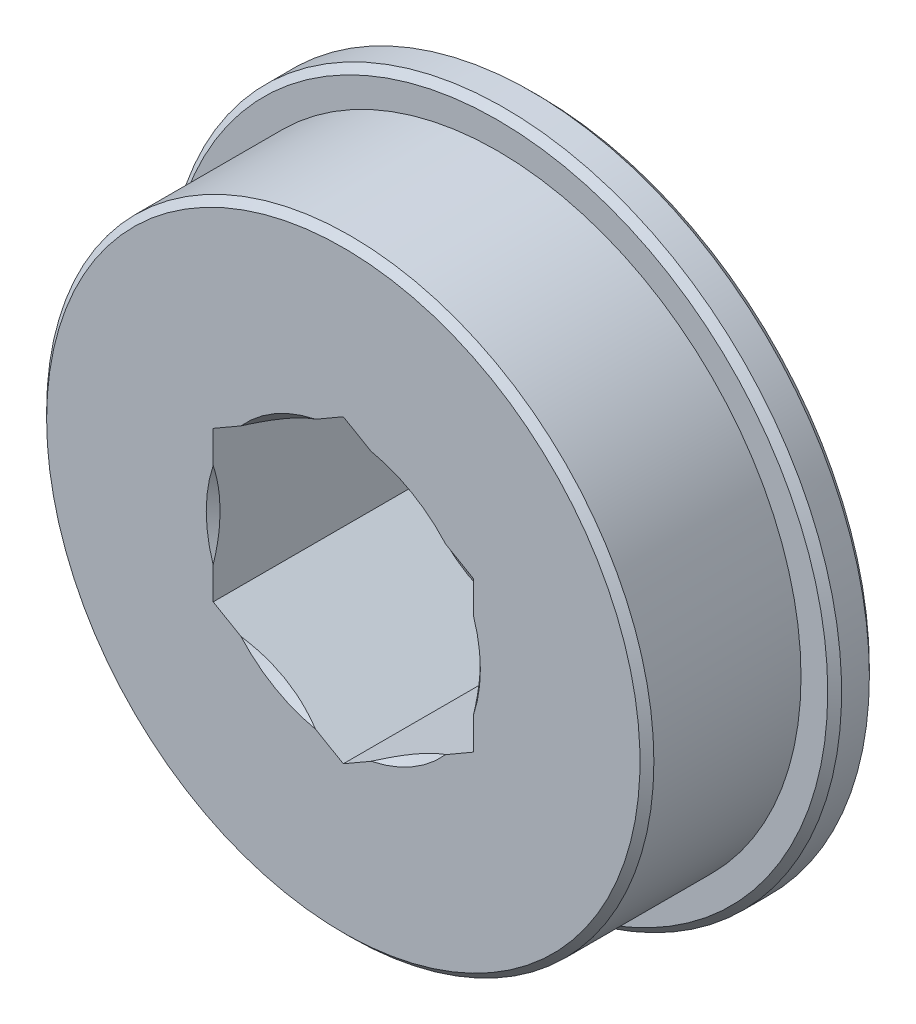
ISO-10303-21;
HEADER;
FILE_DESCRIPTION(('STEP AP214'),'2;1');
FILE_NAME('part.step','',(''),(''),'','','');
FILE_SCHEMA(('AUTOMOTIVE_DESIGN { 1 0 10303 214 1 1 1 1 }'));
ENDSEC;
DATA;
#1=APPLICATION_CONTEXT('core data for automotive mechanical design processes');
#2=APPLICATION_PROTOCOL_DEFINITION('international standard','automotive_design',2000,#1);
#3=PRODUCT_CONTEXT('',#1,'mechanical');
#4=PRODUCT('Part','Part','',(#3));
#5=PRODUCT_RELATED_PRODUCT_CATEGORY('part','',(#4));
#6=PRODUCT_DEFINITION_FORMATION('','',#4);
#7=PRODUCT_DEFINITION_CONTEXT('part definition',#1,'design');
#8=PRODUCT_DEFINITION('design','',#6,#7);
#9=PRODUCT_DEFINITION_SHAPE('','',#8);
#10=(LENGTH_UNIT() NAMED_UNIT(*) SI_UNIT(.MILLI.,.METRE.));
#11=(NAMED_UNIT(*) PLANE_ANGLE_UNIT() SI_UNIT($,.RADIAN.));
#12=(NAMED_UNIT(*) SI_UNIT($,.STERADIAN.) SOLID_ANGLE_UNIT());
#13=UNCERTAINTY_MEASURE_WITH_UNIT(LENGTH_MEASURE(1.E-05),#10,'distance_accuracy_value','');
#14=(GEOMETRIC_REPRESENTATION_CONTEXT(3) GLOBAL_UNCERTAINTY_ASSIGNED_CONTEXT((#13)) GLOBAL_UNIT_ASSIGNED_CONTEXT((#10,
#11,#12)) REPRESENTATION_CONTEXT('',''));
#15=CARTESIAN_POINT('',(0.,0.,0.));
#16=DIRECTION('',(0.,0.,1.));
#17=DIRECTION('',(1.,0.,0.));
#18=AXIS2_PLACEMENT_3D('',#15,#16,#17);
#19=CARTESIAN_POINT('',(-8.86153846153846,6.04195804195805,7.1628));
#20=DIRECTION('',(0.,0.,-1.));
#21=DIRECTION('',(-1.,0.,0.));
#22=AXIS2_PLACEMENT_3D('',#19,#20,#21);
#23=CYLINDRICAL_SURFACE('',#22,11.1125);
#24=CARTESIAN_POINT('',(-8.86153846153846,6.04195804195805,1.524));
#25=DIRECTION('',(0.,0.,-1.));
#26=DIRECTION('',(-1.,0.,0.));
#27=AXIS2_PLACEMENT_3D('',#24,#25,#26);
#28=CIRCLE('',#27,11.1125);
#29=CARTESIAN_POINT('',(-19.9740384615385,6.04195804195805,1.524));
#30=VERTEX_POINT('',#29);
#31=EDGE_CURVE('E20',#30,#30,#28,.F.);
#32=ORIENTED_EDGE('',*,*,#31,.T.);
#33=EDGE_LOOP('',(#32));
#34=FACE_BOUND('',#33,.T.);
#35=CARTESIAN_POINT('',(-8.86153846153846,6.04195804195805,6.90879999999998));
#36=DIRECTION('',(0.,0.,-1.));
#37=DIRECTION('',(-1.,0.,0.));
#38=AXIS2_PLACEMENT_3D('',#35,#36,#37);
#39=CIRCLE('',#38,11.1125);
#40=CARTESIAN_POINT('',(-19.9740384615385,6.04195804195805,6.90879999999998));
#41=VERTEX_POINT('',#40);
#42=EDGE_CURVE('E181',#41,#41,#39,.F.);
#43=ORIENTED_EDGE('',*,*,#42,.F.);
#44=EDGE_LOOP('',(#43));
#45=FACE_BOUND('',#44,.T.);
#46=ADVANCED_FACE('F17',(#34,#45),#23,.T.);
#47=CARTESIAN_POINT('',(-8.86153846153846,6.04195804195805,6.90879999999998));
#48=DIRECTION('',(0.,0.,-1.));
#49=DIRECTION('',(-1.,0.,0.));
#50=AXIS2_PLACEMENT_3D('',#47,#48,#49);
#51=CONICAL_SURFACE('',#50,11.1125,0.785398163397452);
#52=ORIENTED_EDGE('',*,*,#42,.T.);
#53=EDGE_LOOP('',(#52));
#54=FACE_BOUND('',#53,.T.);
#55=CARTESIAN_POINT('',(-8.86153846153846,6.04195804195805,7.16279999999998));
#56=DIRECTION('',(0.,0.,-1.));
#57=DIRECTION('',(-1.,0.,0.));
#58=AXIS2_PLACEMENT_3D('',#55,#56,#57);
#59=CIRCLE('',#58,10.8585);
#60=CARTESIAN_POINT('',(-19.7200384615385,6.04195804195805,7.16279999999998));
#61=VERTEX_POINT('',#60);
#62=EDGE_CURVE('E158',#61,#61,#59,.T.);
#63=ORIENTED_EDGE('',*,*,#62,.T.);
#64=EDGE_LOOP('',(#63));
#65=FACE_BOUND('',#64,.T.);
#66=ADVANCED_FACE('F486',(#54,#65),#51,.T.);
#67=CARTESIAN_POINT('',(-8.86153846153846,6.04195804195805,1.524));
#68=DIRECTION('',(0.,0.,-1.));
#69=DIRECTION('',(-1.,0.,0.));
#70=AXIS2_PLACEMENT_3D('',#67,#68,#69);
#71=PLANE('',#70);
#72=ORIENTED_EDGE('',*,*,#31,.F.);
#73=EDGE_LOOP('',(#72));
#74=FACE_BOUND('',#73,.T.);
#75=CARTESIAN_POINT('',(-8.86153846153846,6.04195804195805,1.52399999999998));
#76=DIRECTION('',(0.,0.,-1.));
#77=DIRECTION('',(-1.,0.,0.));
#78=AXIS2_PLACEMENT_3D('',#75,#76,#77);
#79=CIRCLE('',#78,12.0904);
#80=CARTESIAN_POINT('',(-20.9519384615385,6.04195804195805,1.52399999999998));
#81=VERTEX_POINT('',#80);
#82=EDGE_CURVE('E470',#81,#81,#79,.T.);
#83=ORIENTED_EDGE('',*,*,#82,.F.);
#84=EDGE_LOOP('',(#83));
#85=FACE_BOUND('',#84,.T.);
#86=ADVANCED_FACE('F483',(#74,#85),#71,.F.);
#87=CARTESIAN_POINT('',(-8.86153846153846,6.04195804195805,7.1628));
#88=DIRECTION('',(0.,0.,-1.));
#89=DIRECTION('',(-1.,0.,0.));
#90=AXIS2_PLACEMENT_3D('',#87,#88,#89);
#91=PLANE('',#90);
#92=DIRECTION('',(0.,1.,0.));
#93=VECTOR('',#92,1.);
#94=CARTESIAN_POINT('',(-13.6240384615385,6.04195804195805,7.1628));
#95=LINE('',#94,#93);
#96=CARTESIAN_POINT('',(-13.6240384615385,4.46592948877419,7.1627999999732));
#97=VERTEX_POINT('',#96);
#98=CARTESIAN_POINT('',(-13.6240384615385,3.29232738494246,7.1628));
#99=VERTEX_POINT('',#98);
#100=EDGE_CURVE('E123',#97,#99,#95,.F.);
#101=ORIENTED_EDGE('',*,*,#100,.F.);
#102=CARTESIAN_POINT('',(-8.86153846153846,6.04195804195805,7.1627999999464));
#103=DIRECTION('',(0.,0.,1.));
#104=DIRECTION('',(0.,-1.,0.));
#105=AXIS2_PLACEMENT_3D('',#102,#103,#104);
#106=CIRCLE('',#105,5.01650000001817);
#107=CARTESIAN_POINT('',(-13.6240384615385,7.61798659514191,7.1627999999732));
#108=VERTEX_POINT('',#107);
#109=EDGE_CURVE('E423',#97,#108,#106,.F.);
#110=ORIENTED_EDGE('',*,*,#109,.T.);
#111=DIRECTION('',(0.,1.,0.));
#112=VECTOR('',#111,1.);
#113=CARTESIAN_POINT('',(-13.6240384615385,6.04195804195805,7.1628));
#114=LINE('',#113,#112);
#115=CARTESIAN_POINT('',(-13.6240384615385,8.79158869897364,7.1628));
#116=VERTEX_POINT('',#115);
#117=EDGE_CURVE('E115',#116,#108,#114,.F.);
#118=ORIENTED_EDGE('',*,*,#117,.F.);
#119=DIRECTION('',(-0.866025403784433,-0.500000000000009,0.));
#120=VECTOR('',#119,1.);
#121=CARTESIAN_POINT('',(-12.6076692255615,9.37838975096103,7.1628));
#122=LINE('',#121,#120);
#123=CARTESIAN_POINT('',(-12.6076692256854,9.37838975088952,7.1627999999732));
#124=VERTEX_POINT('',#123);
#125=EDGE_CURVE('E430',#124,#116,#122,.T.);
#126=ORIENTED_EDGE('',*,*,#125,.F.);
#127=CARTESIAN_POINT('',(-8.86153846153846,6.04195804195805,7.1627999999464));
#128=DIRECTION('',(0.,0.,1.));
#129=DIRECTION('',(0.,-1.,0.));
#130=AXIS2_PLACEMENT_3D('',#127,#128,#129);
#131=CIRCLE('',#130,5.01650000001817);
#132=CARTESIAN_POINT('',(-9.87790769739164,10.9544183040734,7.1627999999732));
#133=VERTEX_POINT('',#132);
#134=EDGE_CURVE('E463',#124,#133,#131,.F.);
#135=ORIENTED_EDGE('',*,*,#134,.T.);
#136=DIRECTION('',(-0.866025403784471,-0.499999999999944,0.));
#137=VECTOR('',#136,1.);
#138=CARTESIAN_POINT('',(-8.86153846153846,11.5412193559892,7.1628));
#139=LINE('',#138,#137);
#140=CARTESIAN_POINT('',(-8.86153846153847,11.5412193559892,7.1628));
#141=VERTEX_POINT('',#140);
#142=EDGE_CURVE('E434',#141,#133,#139,.T.);
#143=ORIENTED_EDGE('',*,*,#142,.F.);
#144=DIRECTION('',(-0.866025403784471,0.499999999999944,0.));
#145=VECTOR('',#144,1.);
#146=CARTESIAN_POINT('',(-7.84516922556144,10.9544183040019,7.1628));
#147=LINE('',#146,#145);
#148=CARTESIAN_POINT('',(-7.84516922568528,10.9544183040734,7.1627999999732));
#149=VERTEX_POINT('',#148);
#150=EDGE_CURVE('E438',#149,#141,#147,.T.);
#151=ORIENTED_EDGE('',*,*,#150,.F.);
#152=CARTESIAN_POINT('',(-8.86153846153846,6.04195804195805,7.1627999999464));
#153=DIRECTION('',(0.,0.,1.));
#154=DIRECTION('',(0.,-1.,0.));
#155=AXIS2_PLACEMENT_3D('',#152,#153,#154);
#156=CIRCLE('',#155,5.01650000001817);
#157=CARTESIAN_POINT('',(-5.11540769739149,9.37838975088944,7.1627999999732));
#158=VERTEX_POINT('',#157);
#159=EDGE_CURVE('E460',#149,#158,#156,.F.);
#160=ORIENTED_EDGE('',*,*,#159,.T.);
#161=DIRECTION('',(-0.866025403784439,0.499999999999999,0.));
#162=VECTOR('',#161,1.);
#163=CARTESIAN_POINT('',(-4.09903846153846,8.79158869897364,7.1628));
#164=LINE('',#163,#162);
#165=CARTESIAN_POINT('',(-4.09903846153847,8.79158869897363,7.1628));
#166=VERTEX_POINT('',#165);
#167=EDGE_CURVE('E442',#166,#158,#164,.T.);
#168=ORIENTED_EDGE('',*,*,#167,.F.);
#169=DIRECTION('',(0.,1.,0.));
#170=VECTOR('',#169,1.);
#171=CARTESIAN_POINT('',(-4.09903846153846,6.04195804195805,7.1628));
#172=LINE('',#171,#170);
#173=CARTESIAN_POINT('',(-4.09903846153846,7.61798659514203,7.1627999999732));
#174=VERTEX_POINT('',#173);
#175=EDGE_CURVE('E446',#174,#166,#172,.T.);
#176=ORIENTED_EDGE('',*,*,#175,.F.);
#177=CARTESIAN_POINT('',(-8.86153846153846,6.04195804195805,7.1627999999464));
#178=DIRECTION('',(0.,0.,1.));
#179=DIRECTION('',(0.,-1.,0.));
#180=AXIS2_PLACEMENT_3D('',#177,#178,#179);
#181=CIRCLE('',#180,5.01650000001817);
#182=CARTESIAN_POINT('',(-4.09903846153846,4.46592948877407,7.1627999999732));
#183=VERTEX_POINT('',#182);
#184=EDGE_CURVE('E458',#174,#183,#181,.F.);
#185=ORIENTED_EDGE('',*,*,#184,.T.);
#186=DIRECTION('',(0.,1.,0.));
#187=VECTOR('',#186,1.);
#188=CARTESIAN_POINT('',(-4.09903846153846,6.04195804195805,7.1628));
#189=LINE('',#188,#187);
#190=CARTESIAN_POINT('',(-4.09903846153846,3.29232738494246,7.1628));
#191=VERTEX_POINT('',#190);
#192=EDGE_CURVE('E172',#191,#183,#189,.T.);
#193=ORIENTED_EDGE('',*,*,#192,.F.);
#194=DIRECTION('',(0.866025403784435,0.500000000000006,0.));
#195=VECTOR('',#194,1.);
#196=CARTESIAN_POINT('',(-5.11540769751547,2.70552633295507,7.1628));
#197=LINE('',#196,#195);
#198=CARTESIAN_POINT('',(-5.11540769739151,2.70552633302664,7.1627999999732));
#199=VERTEX_POINT('',#198);
#200=EDGE_CURVE('E140',#199,#191,#197,.T.);
#201=ORIENTED_EDGE('',*,*,#200,.F.);
#202=CARTESIAN_POINT('',(-8.86153846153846,6.04195804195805,7.1627999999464));
#203=DIRECTION('',(0.,0.,1.));
#204=DIRECTION('',(0.,-1.,0.));
#205=AXIS2_PLACEMENT_3D('',#202,#203,#204);
#206=CIRCLE('',#205,5.01650000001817);
#207=CARTESIAN_POINT('',(-7.84516922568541,1.12949777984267,7.1627999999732));
#208=VERTEX_POINT('',#207);
#209=EDGE_CURVE('E169',#199,#208,#206,.F.);
#210=ORIENTED_EDGE('',*,*,#209,.T.);
#211=DIRECTION('',(0.866025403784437,0.500000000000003,0.));
#212=VECTOR('',#211,1.);
#213=CARTESIAN_POINT('',(-8.86153846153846,0.542696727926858,7.1628));
#214=LINE('',#213,#212);
#215=CARTESIAN_POINT('',(-8.86153846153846,0.542696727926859,7.1628));
#216=VERTEX_POINT('',#215);
#217=EDGE_CURVE('E157',#216,#208,#214,.T.);
#218=ORIENTED_EDGE('',*,*,#217,.F.);
#219=DIRECTION('',(0.866025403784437,-0.500000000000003,0.));
#220=VECTOR('',#219,1.);
#221=CARTESIAN_POINT('',(-9.87790769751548,1.12949777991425,7.1628));
#222=LINE('',#221,#220);
#223=CARTESIAN_POINT('',(-9.87790769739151,1.12949777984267,7.1627999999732));
#224=VERTEX_POINT('',#223);
#225=EDGE_CURVE('E146',#224,#216,#222,.T.);
#226=ORIENTED_EDGE('',*,*,#225,.F.);
#227=CARTESIAN_POINT('',(-8.86153846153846,6.04195804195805,7.1627999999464));
#228=DIRECTION('',(0.,0.,1.));
#229=DIRECTION('',(0.,-1.,0.));
#230=AXIS2_PLACEMENT_3D('',#227,#228,#229);
#231=CIRCLE('',#230,5.01650000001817);
#232=CARTESIAN_POINT('',(-12.6076692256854,2.70552633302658,7.1627999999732));
#233=VERTEX_POINT('',#232);
#234=EDGE_CURVE('E465',#224,#233,#231,.F.);
#235=ORIENTED_EDGE('',*,*,#234,.T.);
#236=DIRECTION('',(0.866025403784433,-0.50000000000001,0.));
#237=VECTOR('',#236,1.);
#238=CARTESIAN_POINT('',(-13.6240384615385,3.29232738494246,7.1628));
#239=LINE('',#238,#237);
#240=EDGE_CURVE('E421',#99,#233,#239,.T.);
#241=ORIENTED_EDGE('',*,*,#240,.F.);
#242=EDGE_LOOP('',(#101,#110,#118,#126,#135,#143,#151,#160,#168,#176,#185,#193,#201,#210,#218,
#226,#235,#241));
#243=FACE_BOUND('',#242,.T.);
#244=ORIENTED_EDGE('',*,*,#62,.F.);
#245=EDGE_LOOP('',(#244));
#246=FACE_BOUND('',#245,.T.);
#247=ADVANCED_FACE('F166',(#243,#246),#91,.F.);
#248=CARTESIAN_POINT('',(-8.86153846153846,6.04195804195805,7.1627999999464));
#249=DIRECTION('',(0.,0.,1.));
#250=DIRECTION('',(0.,-1.,0.));
#251=AXIS2_PLACEMENT_3D('',#248,#249,#250);
#252=CONICAL_SURFACE('',#251,5.01650000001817,0.785398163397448);
#253=ORIENTED_EDGE('',*,*,#109,.F.);
#254=CARTESIAN_POINT('',(-13.6240384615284,7.61798659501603,7.16279999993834));
#255=CARTESIAN_POINT('',(-13.6240384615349,7.49847319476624,7.12522654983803));
#256=CARTESIAN_POINT('',(-13.6240384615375,7.3777880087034,7.09118390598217));
#257=CARTESIAN_POINT('',(-13.6240384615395,7.13432202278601,7.03105245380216));
#258=CARTESIAN_POINT('',(-13.6240384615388,7.01153908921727,7.00497232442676));
#259=CARTESIAN_POINT('',(-13.6240384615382,6.76726049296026,6.9622463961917));
#260=CARTESIAN_POINT('',(-13.6240384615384,6.64580129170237,6.94539531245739));
#261=CARTESIAN_POINT('',(-13.6240384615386,6.40201664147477,6.92085246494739));
#262=CARTESIAN_POINT('',(-13.6240384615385,6.27969165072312,6.91315617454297));
#263=CARTESIAN_POINT('',(-13.6240384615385,6.01608974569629,6.90678178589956));
#264=CARTESIAN_POINT('',(-13.6240384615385,5.87477215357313,6.90966083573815));
#265=CARTESIAN_POINT('',(-13.6240384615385,5.59284499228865,6.92785662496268));
#266=CARTESIAN_POINT('',(-13.6240384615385,5.45223605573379,6.94318298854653));
#267=CARTESIAN_POINT('',(-13.6240384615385,5.16899142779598,6.98606942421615));
#268=CARTESIAN_POINT('',(-13.6240384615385,5.0264057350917,7.01395312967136));
#269=CARTESIAN_POINT('',(-13.6240384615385,4.74399108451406,7.08058528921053));
#270=CARTESIAN_POINT('',(-13.6240384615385,4.60415854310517,7.11931846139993));
#271=CARTESIAN_POINT('',(-13.6240384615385,4.46592948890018,7.16279999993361));
#272=B_SPLINE_CURVE_WITH_KNOTS('',3,(#254,#255,#256,#257,#258,#259,#260,#261,#262,#263,#264,
#265,#266,#267,#268,#269,#270,#271),.UNSPECIFIED.,.F.,.F.,(4,2,2,2,2,2,2,2,4),(0.,
0.375875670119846,0.752159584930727,1.11969331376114,1.48704523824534,1.91051162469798,
2.33430574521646,2.76970945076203,3.20450293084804),.UNSPECIFIED.);
#273=EDGE_CURVE('E406',#108,#97,#272,.T.);
#274=ORIENTED_EDGE('',*,*,#273,.F.);
#275=EDGE_LOOP('',(#253,#274));
#276=FACE_BOUND('',#275,.T.);
#277=ADVANCED_FACE('F501',(#276),#252,.F.);
#278=CARTESIAN_POINT('',(-8.86153846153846,6.04195804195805,-1.13686837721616E-10));
#279=DIRECTION('',(0.,0.,-1.));
#280=DIRECTION('',(-1.,0.,0.));
#281=AXIS2_PLACEMENT_3D('',#278,#279,#280);
#282=CONICAL_SURFACE('',#281,5.01650000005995,0.785398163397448);
#283=CARTESIAN_POINT('',(-8.86153846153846,6.04195804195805,-5.6843418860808E-11));
#284=DIRECTION('',(0.,0.,-1.));
#285=DIRECTION('',(-1.,0.,0.));
#286=AXIS2_PLACEMENT_3D('',#283,#284,#285);
#287=CIRCLE('',#286,5.0165000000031);
#288=CARTESIAN_POINT('',(-13.6240384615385,7.61798659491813,-2.84060969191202E-11));
#289=VERTEX_POINT('',#288);
#290=CARTESIAN_POINT('',(-13.6240384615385,4.46592948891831,-5.34331540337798E-11));
#291=VERTEX_POINT('',#290);
#292=EDGE_CURVE('E473',#289,#291,#287,.F.);
#293=ORIENTED_EDGE('',*,*,#292,.F.);
#294=CARTESIAN_POINT('',(-13.6240384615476,4.46592948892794,-4.61527595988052E-11));
#295=CARTESIAN_POINT('',(-13.6240384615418,4.58544288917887,0.0375734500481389));
#296=CARTESIAN_POINT('',(-13.6240384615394,4.70612807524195,0.0716160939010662));
#297=CARTESIAN_POINT('',(-13.6240384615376,4.9495940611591,0.131747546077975));
#298=CARTESIAN_POINT('',(-13.6240384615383,5.07237699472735,0.157827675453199));
#299=CARTESIAN_POINT('',(-13.6240384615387,5.31665559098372,0.200553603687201));
#300=CARTESIAN_POINT('',(-13.6240384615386,5.43811479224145,0.217404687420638));
#301=CARTESIAN_POINT('',(-13.6240384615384,5.6818994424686,0.241947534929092));
#302=CARTESIAN_POINT('',(-13.6240384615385,5.80422443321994,0.249643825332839));
#303=CARTESIAN_POINT('',(-13.6240384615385,6.06782633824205,0.256018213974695));
#304=CARTESIAN_POINT('',(-13.6240384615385,6.20914393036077,0.253139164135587));
#305=CARTESIAN_POINT('',(-13.6240384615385,6.49107109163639,0.234943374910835));
#306=CARTESIAN_POINT('',(-13.6240384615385,6.63168002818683,0.219617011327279));
#307=CARTESIAN_POINT('',(-13.6240384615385,6.9149246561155,0.176730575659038));
#308=CARTESIAN_POINT('',(-13.6240384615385,7.05751034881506,0.148846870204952));
#309=CARTESIAN_POINT('',(-13.6240384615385,7.33992499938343,0.0822147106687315));
#310=CARTESIAN_POINT('',(-13.6240384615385,7.47975754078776,0.0434815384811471));
#311=CARTESIAN_POINT('',(-13.6240384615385,7.61798659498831,-5.04518885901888E-11));
#312=B_SPLINE_CURVE_WITH_KNOTS('',3,(#294,#295,#296,#297,#298,#299,#300,#301,#302,#303,#304,
#305,#306,#307,#308,#309,#310,#311),.UNSPECIFIED.,.F.,.F.,(4,2,2,2,2,2,2,2,4),(0.,
0.375875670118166,0.752159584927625,1.11969331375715,1.48704523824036,1.91051162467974,
2.33430574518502,2.76970945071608,3.2045029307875),.UNSPECIFIED.);
#313=EDGE_CURVE('E400',#291,#289,#312,.T.);
#314=ORIENTED_EDGE('',*,*,#313,.F.);
#315=EDGE_LOOP('',(#293,#314));
#316=FACE_BOUND('',#315,.T.);
#317=ADVANCED_FACE('F493',(#316),#282,.F.);
#318=CARTESIAN_POINT('',(-8.86153846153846,6.04195804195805,1.26999999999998));
#319=DIRECTION('',(0.,0.,-1.));
#320=DIRECTION('',(-1.,0.,0.));
#321=AXIS2_PLACEMENT_3D('',#318,#319,#320);
#322=CONICAL_SURFACE('',#321,12.3444,0.785398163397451);
#323=CARTESIAN_POINT('',(-8.86153846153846,6.04195804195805,1.27));
#324=DIRECTION('',(0.,0.,-1.));
#325=DIRECTION('',(-1.,0.,0.));
#326=AXIS2_PLACEMENT_3D('',#323,#324,#325);
#327=CIRCLE('',#326,12.3444);
#328=CARTESIAN_POINT('',(-21.2059384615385,6.04195804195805,1.27));
#329=VERTEX_POINT('',#328);
#330=EDGE_CURVE('E389',#329,#329,#327,.T.);
#331=ORIENTED_EDGE('',*,*,#330,.F.);
#332=EDGE_LOOP('',(#331));
#333=FACE_BOUND('',#332,.T.);
#334=ORIENTED_EDGE('',*,*,#82,.T.);
#335=EDGE_LOOP('',(#334));
#336=FACE_BOUND('',#335,.T.);
#337=ADVANCED_FACE('F490',(#333,#336),#322,.T.);
#338=CARTESIAN_POINT('',(-8.86153846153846,6.04195804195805,7.1627999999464));
#339=DIRECTION('',(0.,0.,1.));
#340=DIRECTION('',(0.,-1.,0.));
#341=AXIS2_PLACEMENT_3D('',#338,#339,#340);
#342=CONICAL_SURFACE('',#341,5.01650000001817,0.785398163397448);
#343=ORIENTED_EDGE('',*,*,#234,.F.);
#344=CARTESIAN_POINT('',(-12.6076692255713,2.7055263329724,7.16279999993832));
#345=CARTESIAN_POINT('',(-12.5041675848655,2.64576963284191,7.125226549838));
#346=CARTESIAN_POINT('',(-12.399651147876,2.58542703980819,7.09118390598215));
#347=CARTESIAN_POINT('',(-12.1888034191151,2.46369404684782,7.03105245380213));
#348=CARTESIAN_POINT('',(-12.082470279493,2.40230258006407,7.00497232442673));
#349=CARTESIAN_POINT('',(-11.8709188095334,2.280163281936,6.96224639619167));
#350=CARTESIAN_POINT('',(-11.7657320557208,2.2194336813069,6.94539531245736));
#351=CARTESIAN_POINT('',(-11.5546083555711,2.09754135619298,6.92085246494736));
#352=CARTESIAN_POINT('',(-11.4486718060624,2.0363788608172,6.91315617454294));
#353=CARTESIAN_POINT('',(-11.2203858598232,1.90457790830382,6.90678178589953));
#354=CARTESIAN_POINT('',(-11.0980012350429,1.83391911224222,6.90966083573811));
#355=CARTESIAN_POINT('',(-10.8538451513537,1.69295553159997,6.92785662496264));
#356=CARTESIAN_POINT('',(-10.7320742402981,1.62265106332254,6.94318298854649));
#357=CARTESIAN_POINT('',(-10.4867771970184,1.48102874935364,6.98606942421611));
#358=CARTESIAN_POINT('',(-10.3632943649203,1.4097359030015,7.01395312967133));
#359=CARTESIAN_POINT('',(-10.1187161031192,1.26852857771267,7.08058528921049));
#360=CARTESIAN_POINT('',(-9.99761756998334,1.19861230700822,7.11931846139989));
#361=CARTESIAN_POINT('',(-9.87790769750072,1.12949777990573,7.16279999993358));
#362=B_SPLINE_CURVE_WITH_KNOTS('',3,(#344,#345,#346,#347,#348,#349,#350,#351,#352,#353,#354,
#355,#356,#357,#358,#359,#360,#361),.UNSPECIFIED.,.F.,.F.,(4,2,2,2,2,2,2,2,4),(0.,
0.375875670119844,0.752159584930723,1.11969331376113,1.48704523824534,1.91051162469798,
2.33430574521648,2.76970945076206,3.20450293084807),.UNSPECIFIED.);
#363=EDGE_CURVE('E152',#233,#224,#362,.T.);
#364=ORIENTED_EDGE('',*,*,#363,.F.);
#365=EDGE_LOOP('',(#343,#364));
#366=FACE_BOUND('',#365,.T.);
#367=ADVANCED_FACE('F492',(#366),#342,.F.);
#368=CARTESIAN_POINT('',(-8.86153846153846,6.04195804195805,7.1627999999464));
#369=DIRECTION('',(0.,0.,1.));
#370=DIRECTION('',(0.,-1.,0.));
#371=AXIS2_PLACEMENT_3D('',#368,#369,#370);
#372=CONICAL_SURFACE('',#371,5.01650000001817,0.785398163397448);
#373=ORIENTED_EDGE('',*,*,#209,.F.);
#374=CARTESIAN_POINT('',(-7.84516922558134,1.12949777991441,7.16279999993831));
#375=CARTESIAN_POINT('',(-7.74166758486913,1.18925448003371,7.12522654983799));
#376=CARTESIAN_POINT('',(-7.63715114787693,1.24959707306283,7.09118390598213));
#377=CARTESIAN_POINT('',(-7.42630341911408,1.37133006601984,7.03105245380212));
#378=CARTESIAN_POINT('',(-7.31997027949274,1.43272153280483,7.00497232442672));
#379=CARTESIAN_POINT('',(-7.10841880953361,1.55486083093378,6.96224639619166));
#380=CARTESIAN_POINT('',(-7.00323205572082,1.61559043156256,6.94539531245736));
#381=CARTESIAN_POINT('',(-6.79210835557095,1.73748275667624,6.92085246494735));
#382=CARTESIAN_POINT('',(-6.68617180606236,1.7986452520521,6.91315617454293));
#383=CARTESIAN_POINT('',(-6.45788585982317,1.93044620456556,6.90678178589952));
#384=CARTESIAN_POINT('',(-6.33550123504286,2.00110500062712,6.90966083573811));
#385=CARTESIAN_POINT('',(-6.09134515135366,2.14206858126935,6.92785662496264));
#386=CARTESIAN_POINT('',(-5.96957424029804,2.21237304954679,6.94318298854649));
#387=CARTESIAN_POINT('',(-5.72427719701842,2.3539953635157,6.98606942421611));
#388=CARTESIAN_POINT('',(-5.60079436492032,2.42528820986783,7.01395312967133));
#389=CARTESIAN_POINT('',(-5.35621610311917,2.56649553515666,7.08058528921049));
#390=CARTESIAN_POINT('',(-5.23511756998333,2.6364118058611,7.11931846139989));
#391=CARTESIAN_POINT('',(-5.11540769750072,2.7055263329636,7.16279999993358));
#392=B_SPLINE_CURVE_WITH_KNOTS('',3,(#374,#375,#376,#377,#378,#379,#380,#381,#382,#383,#384,
#385,#386,#387,#388,#389,#390,#391),.UNSPECIFIED.,.F.,.F.,(4,2,2,2,2,2,2,2,4),(0.,
0.375875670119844,0.752159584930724,1.11969331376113,1.48704523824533,1.91051162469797,
2.33430574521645,2.76970945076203,3.20450293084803),.UNSPECIFIED.);
#393=EDGE_CURVE('E277',#208,#199,#392,.T.);
#394=ORIENTED_EDGE('',*,*,#393,.F.);
#395=EDGE_LOOP('',(#373,#394));
#396=FACE_BOUND('',#395,.T.);
#397=ADVANCED_FACE('F267',(#396),#372,.F.);
#398=CARTESIAN_POINT('',(-8.86153846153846,6.04195804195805,7.1627999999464));
#399=DIRECTION('',(0.,0.,1.));
#400=DIRECTION('',(0.,-1.,0.));
#401=AXIS2_PLACEMENT_3D('',#398,#399,#400);
#402=CONICAL_SURFACE('',#401,5.01650000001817,0.785398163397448);
#403=ORIENTED_EDGE('',*,*,#184,.F.);
#404=CARTESIAN_POINT('',(-4.09903846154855,4.46592948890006,7.16279999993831));
#405=CARTESIAN_POINT('',(-4.09903846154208,4.58544288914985,7.12522654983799));
#406=CARTESIAN_POINT('',(-4.09903846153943,4.70612807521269,7.09118390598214));
#407=CARTESIAN_POINT('',(-4.09903846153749,4.94959406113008,7.03105245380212));
#408=CARTESIAN_POINT('',(-4.0990384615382,5.07237699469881,7.00497232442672));
#409=CARTESIAN_POINT('',(-4.09903846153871,5.31665559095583,6.96224639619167));
#410=CARTESIAN_POINT('',(-4.09903846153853,5.43811479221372,6.94539531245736));
#411=CARTESIAN_POINT('',(-4.09903846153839,5.68189944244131,6.92085246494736));
#412=CARTESIAN_POINT('',(-4.09903846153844,5.80422443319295,6.91315617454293));
#413=CARTESIAN_POINT('',(-4.09903846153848,6.06782633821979,6.90678178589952));
#414=CARTESIAN_POINT('',(-4.09903846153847,6.20914393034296,6.90966083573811));
#415=CARTESIAN_POINT('',(-4.09903846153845,6.49107109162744,6.92785662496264));
#416=CARTESIAN_POINT('',(-4.09903846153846,6.63168002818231,6.94318298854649));
#417=CARTESIAN_POINT('',(-4.09903846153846,6.91492465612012,6.98606942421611));
#418=CARTESIAN_POINT('',(-4.09903846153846,7.0575103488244,7.01395312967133));
#419=CARTESIAN_POINT('',(-4.09903846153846,7.33992499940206,7.0805852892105));
#420=CARTESIAN_POINT('',(-4.09903846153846,7.47975754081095,7.1193184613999));
#421=CARTESIAN_POINT('',(-4.09903846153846,7.61798659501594,7.16279999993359));
#422=B_SPLINE_CURVE_WITH_KNOTS('',3,(#404,#405,#406,#407,#408,#409,#410,#411,#412,#413,#414,
#415,#416,#417,#418,#419,#420,#421),.UNSPECIFIED.,.F.,.F.,(4,2,2,2,2,2,2,2,4),(0.,
0.375875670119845,0.752159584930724,1.11969331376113,1.48704523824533,1.91051162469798,
2.33430574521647,2.76970945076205,3.20450293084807),.UNSPECIFIED.);
#423=EDGE_CURVE('E164',#183,#174,#422,.T.);
#424=ORIENTED_EDGE('',*,*,#423,.F.);
#425=EDGE_LOOP('',(#403,#424));
#426=FACE_BOUND('',#425,.T.);
#427=ADVANCED_FACE('F262',(#426),#402,.F.);
#428=CARTESIAN_POINT('',(-8.86153846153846,6.04195804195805,7.1627999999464));
#429=DIRECTION('',(0.,0.,1.));
#430=DIRECTION('',(0.,-1.,0.));
#431=AXIS2_PLACEMENT_3D('',#428,#429,#430);
#432=CONICAL_SURFACE('',#431,5.01650000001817,0.785398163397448);
#433=ORIENTED_EDGE('',*,*,#159,.F.);
#434=CARTESIAN_POINT('',(-5.11540769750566,9.37838975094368,7.16279999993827));
#435=CARTESIAN_POINT('',(-5.21890933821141,9.43814645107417,7.12522654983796));
#436=CARTESIAN_POINT('',(-5.32342577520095,9.49848904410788,7.0911839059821));
#437=CARTESIAN_POINT('',(-5.53427350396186,9.62022203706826,7.03105245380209));
#438=CARTESIAN_POINT('',(-5.64060664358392,9.68161350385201,7.00497232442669));
#439=CARTESIAN_POINT('',(-5.85215811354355,9.80375280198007,6.96224639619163));
#440=CARTESIAN_POINT('',(-5.95734486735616,9.86448240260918,6.94539531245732));
#441=CARTESIAN_POINT('',(-6.16846856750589,9.98637472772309,6.92085246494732));
#442=CARTESIAN_POINT('',(-6.27440511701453,10.0475372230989,6.9131561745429));
#443=CARTESIAN_POINT('',(-6.50269106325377,10.1793381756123,6.90678178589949));
#444=CARTESIAN_POINT('',(-6.62507568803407,10.2499969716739,6.90966083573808));
#445=CARTESIAN_POINT('',(-6.86923177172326,10.3909605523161,6.9278566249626));
#446=CARTESIAN_POINT('',(-6.99100268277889,10.4612650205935,6.94318298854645));
#447=CARTESIAN_POINT('',(-7.23629972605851,10.6028873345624,6.98606942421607));
#448=CARTESIAN_POINT('',(-7.35978255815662,10.6741801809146,7.01395312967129));
#449=CARTESIAN_POINT('',(-7.60436081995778,10.8153875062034,7.08058528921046));
#450=CARTESIAN_POINT('',(-7.72545935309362,10.8853037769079,7.11931846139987));
#451=CARTESIAN_POINT('',(-7.84516922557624,10.9544183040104,7.16279999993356));
#452=B_SPLINE_CURVE_WITH_KNOTS('',3,(#434,#435,#436,#437,#438,#439,#440,#441,#442,#443,#444,
#445,#446,#447,#448,#449,#450,#451),.UNSPECIFIED.,.F.,.F.,(4,2,2,2,2,2,2,2,4),(0.,
0.375875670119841,0.752159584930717,1.11969331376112,1.48704523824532,1.91051162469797,
2.33430574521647,2.76970945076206,3.20450293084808),.UNSPECIFIED.);
#453=EDGE_CURVE('E244',#158,#149,#452,.T.);
#454=ORIENTED_EDGE('',*,*,#453,.F.);
#455=EDGE_LOOP('',(#433,#454));
#456=FACE_BOUND('',#455,.T.);
#457=ADVANCED_FACE('F255',(#456),#432,.F.);
#458=CARTESIAN_POINT('',(-8.86153846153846,6.04195804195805,7.1627999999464));
#459=DIRECTION('',(0.,0.,1.));
#460=DIRECTION('',(0.,-1.,0.));
#461=AXIS2_PLACEMENT_3D('',#458,#459,#460);
#462=CONICAL_SURFACE('',#461,5.01650000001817,0.785398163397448);
#463=ORIENTED_EDGE('',*,*,#134,.F.);
#464=CARTESIAN_POINT('',(-9.87790769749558,10.9544183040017,7.16279999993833));
#465=CARTESIAN_POINT('',(-9.98140933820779,10.8946616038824,7.12522654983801));
#466=CARTESIAN_POINT('',(-10.0859257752,10.8343190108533,7.09118390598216));
#467=CARTESIAN_POINT('',(-10.2967735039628,10.7125860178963,7.03105245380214));
#468=CARTESIAN_POINT('',(-10.4031066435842,10.6511945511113,7.00497232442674));
#469=CARTESIAN_POINT('',(-10.6146581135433,10.5290552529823,6.96224639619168));
#470=CARTESIAN_POINT('',(-10.7198448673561,10.4683256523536,6.94539531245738));
#471=CARTESIAN_POINT('',(-10.930968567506,10.3464333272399,6.92085246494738));
#472=CARTESIAN_POINT('',(-11.0369051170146,10.285270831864,6.91315617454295));
#473=CARTESIAN_POINT('',(-11.2651910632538,10.1534698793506,6.90678178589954));
#474=CARTESIAN_POINT('',(-11.3875756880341,10.082811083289,6.90966083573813));
#475=CARTESIAN_POINT('',(-11.6317317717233,9.94184750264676,6.92785662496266));
#476=CARTESIAN_POINT('',(-11.7535026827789,9.87154303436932,6.94318298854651));
#477=CARTESIAN_POINT('',(-11.9987997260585,9.72992072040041,6.98606942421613));
#478=CARTESIAN_POINT('',(-12.1222825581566,9.65862787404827,7.01395312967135));
#479=CARTESIAN_POINT('',(-12.3668608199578,9.51742054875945,7.08058528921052));
#480=CARTESIAN_POINT('',(-12.4879593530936,9.447504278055,7.11931846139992));
#481=CARTESIAN_POINT('',(-12.6076692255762,9.37838975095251,7.16279999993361));
#482=B_SPLINE_CURVE_WITH_KNOTS('',3,(#464,#465,#466,#467,#468,#469,#470,#471,#472,#473,#474,
#475,#476,#477,#478,#479,#480,#481),.UNSPECIFIED.,.F.,.F.,(4,2,2,2,2,2,2,2,4),(0.,
0.375875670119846,0.752159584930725,1.11969331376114,1.48704523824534,1.91051162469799,
2.33430574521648,2.76970945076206,3.20450293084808),.UNSPECIFIED.);
#483=EDGE_CURVE('E228',#133,#124,#482,.T.);
#484=ORIENTED_EDGE('',*,*,#483,.F.);
#485=EDGE_LOOP('',(#463,#484));
#486=FACE_BOUND('',#485,.T.);
#487=ADVANCED_FACE('F250',(#486),#462,.F.);
#488=CARTESIAN_POINT('',(-13.6240384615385,3.29232738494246,-28.4795820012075));
#489=DIRECTION('',(1.,0.,0.));
#490=DIRECTION('',(0.,0.,-1.));
#491=AXIS2_PLACEMENT_3D('',#488,#489,#490);
#492=PLANE('',#491);
#493=DIRECTION('',(0.,0.,1.));
#494=VECTOR('',#493,1.);
#495=CARTESIAN_POINT('',(-13.6240384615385,8.79158869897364,-28.4795820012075));
#496=LINE('',#495,#494);
#497=CARTESIAN_POINT('',(-13.6240384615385,8.79158869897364,0.));
#498=VERTEX_POINT('',#497);
#499=EDGE_CURVE('E236',#116,#498,#496,.F.);
#500=ORIENTED_EDGE('',*,*,#499,.F.);
#501=ORIENTED_EDGE('',*,*,#117,.T.);
#502=ORIENTED_EDGE('',*,*,#273,.T.);
#503=ORIENTED_EDGE('',*,*,#100,.T.);
#504=DIRECTION('',(0.,0.,1.));
#505=VECTOR('',#504,1.);
#506=CARTESIAN_POINT('',(-13.6240384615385,3.29232738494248,-28.4795820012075));
#507=LINE('',#506,#505);
#508=CARTESIAN_POINT('',(-13.6240384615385,3.29232738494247,0.));
#509=VERTEX_POINT('',#508);
#510=EDGE_CURVE('E382',#509,#99,#507,.T.);
#511=ORIENTED_EDGE('',*,*,#510,.F.);
#512=DIRECTION('',(0.,1.,0.));
#513=VECTOR('',#512,1.);
#514=CARTESIAN_POINT('',(-13.6240384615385,3.29232738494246,0.));
#515=LINE('',#514,#513);
#516=EDGE_CURVE('E403',#509,#291,#515,.T.);
#517=ORIENTED_EDGE('',*,*,#516,.T.);
#518=ORIENTED_EDGE('',*,*,#313,.T.);
#519=DIRECTION('',(0.,1.,0.));
#520=VECTOR('',#519,1.);
#521=CARTESIAN_POINT('',(-13.6240384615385,3.29232738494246,0.));
#522=LINE('',#521,#520);
#523=EDGE_CURVE('E330',#289,#498,#522,.T.);
#524=ORIENTED_EDGE('',*,*,#523,.T.);
#525=EDGE_LOOP('',(#500,#501,#502,#503,#511,#517,#518,#524));
#526=FACE_BOUND('',#525,.T.);
#527=ADVANCED_FACE('F254',(#526),#492,.T.);
#528=CARTESIAN_POINT('',(-8.86153846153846,6.04195804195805,1.524));
#529=DIRECTION('',(0.,0.,-1.));
#530=DIRECTION('',(-1.,0.,0.));
#531=AXIS2_PLACEMENT_3D('',#528,#529,#530);
#532=CYLINDRICAL_SURFACE('',#531,12.3444);
#533=ORIENTED_EDGE('',*,*,#330,.T.);
#534=EDGE_LOOP('',(#533));
#535=FACE_BOUND('',#534,.T.);
#536=CARTESIAN_POINT('',(-8.86153846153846,6.04195804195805,0.25400000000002));
#537=DIRECTION('',(0.,0.,1.));
#538=DIRECTION('',(1.,0.,0.));
#539=AXIS2_PLACEMENT_3D('',#536,#537,#538);
#540=CIRCLE('',#539,12.3444);
#541=CARTESIAN_POINT('',(3.48286153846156,6.04195804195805,0.25400000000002));
#542=VERTEX_POINT('',#541);
#543=EDGE_CURVE('E336',#542,#542,#540,.F.);
#544=ORIENTED_EDGE('',*,*,#543,.F.);
#545=EDGE_LOOP('',(#544));
#546=FACE_BOUND('',#545,.T.);
#547=ADVANCED_FACE('F543',(#535,#546),#532,.T.);
#548=CARTESIAN_POINT('',(-8.86153846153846,0.542696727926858,-28.4795820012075));
#549=DIRECTION('',(0.500000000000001,0.866025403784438,0.));
#550=DIRECTION('',(-0.866025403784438,0.500000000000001,0.));
#551=AXIS2_PLACEMENT_3D('',#548,#549,#550);
#552=PLANE('',#551);
#553=ORIENTED_EDGE('',*,*,#510,.T.);
#554=ORIENTED_EDGE('',*,*,#240,.T.);
#555=ORIENTED_EDGE('',*,*,#363,.T.);
#556=ORIENTED_EDGE('',*,*,#225,.T.);
#557=DIRECTION('',(0.,0.,1.));
#558=VECTOR('',#557,1.);
#559=CARTESIAN_POINT('',(-8.86153846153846,0.54269672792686,-28.4795820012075));
#560=LINE('',#559,#558);
#561=CARTESIAN_POINT('',(-8.86153846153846,0.542696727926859,0.));
#562=VERTEX_POINT('',#561);
#563=EDGE_CURVE('E149',#562,#216,#560,.T.);
#564=ORIENTED_EDGE('',*,*,#563,.F.);
#565=DIRECTION('',(-0.866025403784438,0.500000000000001,0.));
#566=VECTOR('',#565,1.);
#567=CARTESIAN_POINT('',(-8.86153846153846,0.542696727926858,0.));
#568=LINE('',#567,#566);
#569=CARTESIAN_POINT('',(-9.87790769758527,1.12949777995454,-2.8421709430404E-11));
#570=VERTEX_POINT('',#569);
#571=EDGE_CURVE('E383',#562,#570,#568,.T.);
#572=ORIENTED_EDGE('',*,*,#571,.T.);
#573=CARTESIAN_POINT('',(-9.87790769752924,1.12949777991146,-4.6112421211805E-11));
#574=CARTESIAN_POINT('',(-9.98140933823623,1.18925448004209,0.0375734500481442));
#575=CARTESIAN_POINT('',(-10.0859257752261,1.24959707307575,0.0716160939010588));
#576=CARTESIAN_POINT('',(-10.2967735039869,1.37133006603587,0.131747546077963));
#577=CARTESIAN_POINT('',(-10.4031066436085,1.43272153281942,0.157827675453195));
#578=CARTESIAN_POINT('',(-10.6146581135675,1.5548608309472,0.200553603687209));
#579=CARTESIAN_POINT('',(-10.71984486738,1.61559043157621,0.217404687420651));
#580=CARTESIAN_POINT('',(-10.9309685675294,1.73748275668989,0.241947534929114));
#581=CARTESIAN_POINT('',(-11.0369051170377,1.79864525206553,0.249643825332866));
#582=CARTESIAN_POINT('',(-11.2651910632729,1.93044620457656,0.256018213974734));
#583=CARTESIAN_POINT('',(-11.3875756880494,2.00110500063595,0.253139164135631));
#584=CARTESIAN_POINT('',(-11.6317317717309,2.1420685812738,0.23494337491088));
#585=CARTESIAN_POINT('',(-11.7535026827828,2.21237304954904,0.219617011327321));
#586=CARTESIAN_POINT('',(-11.9987997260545,2.3539953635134,0.17673057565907));
#587=CARTESIAN_POINT('',(-12.1222825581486,2.4252882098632,0.148846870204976));
#588=CARTESIAN_POINT('',(-12.3668608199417,2.56649553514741,0.0822147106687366));
#589=CARTESIAN_POINT('',(-12.4879593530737,2.63641180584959,0.0434815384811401));
#590=CARTESIAN_POINT('',(-12.6076692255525,2.70552633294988,-5.04738181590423E-11));
#591=B_SPLINE_CURVE_WITH_KNOTS('',3,(#573,#574,#575,#576,#577,#578,#579,#580,#581,#582,#583,
#584,#585,#586,#587,#588,#589,#590),.UNSPECIFIED.,.F.,.F.,(4,2,2,2,2,2,2,2,4),(0.,
0.37587567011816,0.752159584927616,1.11969331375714,1.48704523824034,1.91051162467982,
2.3343057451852,2.76970945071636,3.20450293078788),.UNSPECIFIED.);
#592=CARTESIAN_POINT('',(-12.6076692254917,2.70552633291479,-2.8421709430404E-11));
#593=VERTEX_POINT('',#592);
#594=EDGE_CURVE('E238',#570,#593,#591,.T.);
#595=ORIENTED_EDGE('',*,*,#594,.T.);
#596=DIRECTION('',(-0.866025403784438,0.500000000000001,0.));
#597=VECTOR('',#596,1.);
#598=CARTESIAN_POINT('',(-8.86153846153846,0.542696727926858,0.));
#599=LINE('',#598,#597);
#600=EDGE_CURVE('E379',#593,#509,#599,.T.);
#601=ORIENTED_EDGE('',*,*,#600,.T.);
#602=EDGE_LOOP('',(#553,#554,#555,#556,#564,#572,#595,#601));
#603=FACE_BOUND('',#602,.T.);
#604=ADVANCED_FACE('F148',(#603),#552,.T.);
#605=CARTESIAN_POINT('',(-4.09903846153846,3.29232738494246,-28.4795820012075));
#606=DIRECTION('',(-0.500000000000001,0.866025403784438,0.));
#607=DIRECTION('',(-0.866025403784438,-0.500000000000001,0.));
#608=AXIS2_PLACEMENT_3D('',#605,#606,#607);
#609=PLANE('',#608);
#610=ORIENTED_EDGE('',*,*,#563,.T.);
#611=ORIENTED_EDGE('',*,*,#217,.T.);
#612=ORIENTED_EDGE('',*,*,#393,.T.);
#613=ORIENTED_EDGE('',*,*,#200,.T.);
#614=DIRECTION('',(0.,0.,1.));
#615=VECTOR('',#614,1.);
#616=CARTESIAN_POINT('',(-4.09903846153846,3.29232738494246,-28.4795820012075));
#617=LINE('',#616,#615);
#618=CARTESIAN_POINT('',(-4.09903846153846,3.29232738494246,0.));
#619=VERTEX_POINT('',#618);
#620=EDGE_CURVE('E366',#619,#191,#617,.T.);
#621=ORIENTED_EDGE('',*,*,#620,.F.);
#622=DIRECTION('',(-0.866025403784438,-0.500000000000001,0.));
#623=VECTOR('',#622,1.);
#624=CARTESIAN_POINT('',(-4.09903846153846,3.29232738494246,0.));
#625=LINE('',#624,#623);
#626=CARTESIAN_POINT('',(-5.11540769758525,2.70552633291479,-2.8421709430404E-11));
#627=VERTEX_POINT('',#626);
#628=EDGE_CURVE('E373',#619,#627,#625,.T.);
#629=ORIENTED_EDGE('',*,*,#628,.T.);
#630=CARTESIAN_POINT('',(-5.11540769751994,2.70552633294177,-4.61127327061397E-11));
#631=CARTESIAN_POINT('',(-5.21890933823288,2.64576963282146,0.0375734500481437));
#632=CARTESIAN_POINT('',(-5.32342577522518,2.58542703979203,0.0716160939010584));
#633=CARTESIAN_POINT('',(-5.53427350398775,2.46369404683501,0.131747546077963));
#634=CARTESIAN_POINT('',(-5.6406066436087,2.40230258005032,0.157827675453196));
#635=CARTESIAN_POINT('',(-5.85215811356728,2.28016328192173,0.20055360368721));
#636=CARTESIAN_POINT('',(-5.95734486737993,2.21943368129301,0.217404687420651));
#637=CARTESIAN_POINT('',(-6.1684685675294,2.09754135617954,0.241947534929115));
#638=CARTESIAN_POINT('',(-6.27440511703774,2.03637886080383,0.249643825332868));
#639=CARTESIAN_POINT('',(-6.50269106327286,1.90457790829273,0.256018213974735));
#640=CARTESIAN_POINT('',(-6.62507568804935,1.83391911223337,0.253139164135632));
#641=CARTESIAN_POINT('',(-6.86923177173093,1.69295553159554,0.234943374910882));
#642=CARTESIAN_POINT('',(-6.99100268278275,1.6226510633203,0.219617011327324));
#643=CARTESIAN_POINT('',(-7.2362997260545,1.48102874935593,0.176730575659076));
#644=CARTESIAN_POINT('',(-7.35978255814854,1.40973590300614,0.148846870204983));
#645=CARTESIAN_POINT('',(-7.60436081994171,1.26852857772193,0.0822147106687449));
#646=CARTESIAN_POINT('',(-7.72545935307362,1.19861230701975,0.0434815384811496));
#647=CARTESIAN_POINT('',(-7.84516922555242,1.12949777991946,-5.04622932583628E-11));
#648=B_SPLINE_CURVE_WITH_KNOTS('',3,(#630,#631,#632,#633,#634,#635,#636,#637,#638,#639,#640,
#641,#642,#643,#644,#645,#646,#647),.UNSPECIFIED.,.F.,.F.,(4,2,2,2,2,2,2,2,4),(0.,
0.37587567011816,0.752159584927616,1.11969331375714,1.48704523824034,1.91051162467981,
2.33430574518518,2.76970945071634,3.20450293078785),.UNSPECIFIED.);
#649=CARTESIAN_POINT('',(-7.84516922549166,1.12949777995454,-2.8421709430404E-11));
#650=VERTEX_POINT('',#649);
#651=EDGE_CURVE('E295',#627,#650,#648,.T.);
#652=ORIENTED_EDGE('',*,*,#651,.T.);
#653=DIRECTION('',(-0.866025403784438,-0.500000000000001,0.));
#654=VECTOR('',#653,1.);
#655=CARTESIAN_POINT('',(-4.09903846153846,3.29232738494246,0.));
#656=LINE('',#655,#654);
#657=EDGE_CURVE('E163',#650,#562,#656,.T.);
#658=ORIENTED_EDGE('',*,*,#657,.T.);
#659=EDGE_LOOP('',(#610,#611,#612,#613,#621,#629,#652,#658));
#660=FACE_BOUND('',#659,.T.);
#661=ADVANCED_FACE('F160',(#660),#609,.T.);
#662=CARTESIAN_POINT('',(-4.09903846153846,8.79158869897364,-28.4795820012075));
#663=DIRECTION('',(-1.,0.,0.));
#664=DIRECTION('',(0.,-1.,0.));
#665=AXIS2_PLACEMENT_3D('',#662,#663,#664);
#666=PLANE('',#665);
#667=ORIENTED_EDGE('',*,*,#620,.T.);
#668=ORIENTED_EDGE('',*,*,#192,.T.);
#669=ORIENTED_EDGE('',*,*,#423,.T.);
#670=ORIENTED_EDGE('',*,*,#175,.T.);
#671=DIRECTION('',(0.,0.,1.));
#672=VECTOR('',#671,1.);
#673=CARTESIAN_POINT('',(-4.09903846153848,8.79158869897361,-28.4795820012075));
#674=LINE('',#673,#672);
#675=CARTESIAN_POINT('',(-4.09903846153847,8.79158869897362,0.));
#676=VERTEX_POINT('',#675);
#677=EDGE_CURVE('E237',#676,#166,#674,.T.);
#678=ORIENTED_EDGE('',*,*,#677,.F.);
#679=DIRECTION('',(0.,-1.,0.));
#680=VECTOR('',#679,1.);
#681=CARTESIAN_POINT('',(-4.09903846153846,8.79158869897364,0.));
#682=LINE('',#681,#680);
#683=CARTESIAN_POINT('',(-4.09903846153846,7.61798659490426,-2.40104057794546E-11));
#684=VERTEX_POINT('',#683);
#685=EDGE_CURVE('E276',#676,#684,#682,.T.);
#686=ORIENTED_EDGE('',*,*,#685,.T.);
#687=CARTESIAN_POINT('',(-4.09903846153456,7.6179865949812,-4.63714953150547E-11));
#688=CARTESIAN_POINT('',(-4.09903846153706,7.49847319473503,0.0375734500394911));
#689=CARTESIAN_POINT('',(-4.09903846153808,7.37778800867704,0.0716160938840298));
#690=CARTESIAN_POINT('',(-4.09903846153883,7.13432202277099,0.131747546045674));
#691=CARTESIAN_POINT('',(-4.09903846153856,7.01153908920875,0.157827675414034));
#692=CARTESIAN_POINT('',(-4.09903846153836,6.76726049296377,0.200553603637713));
#693=CARTESIAN_POINT('',(-4.09903846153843,6.6458012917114,0.217404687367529));
#694=CARTESIAN_POINT('',(-4.09903846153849,6.40201664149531,0.241947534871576));
#695=CARTESIAN_POINT('',(-4.09903846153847,6.27969165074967,0.249643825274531));
#696=CARTESIAN_POINT('',(-4.09903846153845,6.01608974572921,0.256018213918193));
#697=CARTESIAN_POINT('',(-4.09903846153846,5.87477215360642,0.253139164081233));
#698=CARTESIAN_POINT('',(-4.09903846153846,5.59284499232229,0.234943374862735));
#699=CARTESIAN_POINT('',(-4.09903846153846,5.4522360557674,0.219617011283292));
#700=CARTESIAN_POINT('',(-4.09903846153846,5.16899142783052,0.176730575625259));
#701=CARTESIAN_POINT('',(-4.09903846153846,5.02640573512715,0.148846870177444));
#702=CARTESIAN_POINT('',(-4.09903846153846,4.74399108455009,0.0822147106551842));
#703=CARTESIAN_POINT('',(-4.09903846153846,4.60415854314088,0.0434815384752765));
#704=CARTESIAN_POINT('',(-4.09903846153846,4.4659294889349,-4.81816617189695E-11));
#705=B_SPLINE_CURVE_WITH_KNOTS('',3,(#687,#688,#689,#690,#691,#692,#693,#694,#695,#696,#697,
#698,#699,#700,#701,#702,#703,#704),.UNSPECIFIED.,.F.,.F.,(4,2,2,2,2,2,2,2,4),(0.,
0.375875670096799,0.752159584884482,1.1196933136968,1.487045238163,1.91051162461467,
2.33430574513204,2.76970945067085,3.20450293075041),.UNSPECIFIED.);
#706=CARTESIAN_POINT('',(-4.09903846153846,4.46592948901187,-2.40026745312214E-11));
#707=VERTEX_POINT('',#706);
#708=EDGE_CURVE('E289',#684,#707,#705,.T.);
#709=ORIENTED_EDGE('',*,*,#708,.T.);
#710=DIRECTION('',(0.,-1.,0.));
#711=VECTOR('',#710,1.);
#712=CARTESIAN_POINT('',(-4.09903846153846,8.79158869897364,0.));
#713=LINE('',#712,#711);
#714=EDGE_CURVE('E363',#707,#619,#713,.T.);
#715=ORIENTED_EDGE('',*,*,#714,.T.);
#716=EDGE_LOOP('',(#667,#668,#669,#670,#678,#686,#709,#715));
#717=FACE_BOUND('',#716,.T.);
#718=ADVANCED_FACE('F283',(#717),#666,.T.);
#719=CARTESIAN_POINT('',(-8.86153846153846,11.5412193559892,-28.4795820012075));
#720=DIRECTION('',(-0.500000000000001,-0.866025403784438,0.));
#721=DIRECTION('',(0.866025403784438,-0.500000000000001,0.));
#722=AXIS2_PLACEMENT_3D('',#719,#720,#721);
#723=PLANE('',#722);
#724=ORIENTED_EDGE('',*,*,#677,.T.);
#725=ORIENTED_EDGE('',*,*,#167,.T.);
#726=ORIENTED_EDGE('',*,*,#453,.T.);
#727=ORIENTED_EDGE('',*,*,#150,.T.);
#728=DIRECTION('',(0.,0.,1.));
#729=VECTOR('',#728,1.);
#730=CARTESIAN_POINT('',(-8.86153846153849,11.5412193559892,-28.4795820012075));
#731=LINE('',#730,#729);
#732=CARTESIAN_POINT('',(-8.86153846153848,11.5412193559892,0.));
#733=VERTEX_POINT('',#732);
#734=EDGE_CURVE('E338',#733,#141,#731,.T.);
#735=ORIENTED_EDGE('',*,*,#734,.F.);
#736=DIRECTION('',(0.866025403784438,-0.500000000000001,0.));
#737=VECTOR('',#736,1.);
#738=CARTESIAN_POINT('',(-8.86153846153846,11.5412193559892,0.));
#739=LINE('',#738,#737);
#740=CARTESIAN_POINT('',(-7.84516922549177,10.9544183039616,-2.8421709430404E-11));
#741=VERTEX_POINT('',#740);
#742=EDGE_CURVE('E357',#733,#741,#739,.T.);
#743=ORIENTED_EDGE('',*,*,#742,.T.);
#744=CARTESIAN_POINT('',(-7.84516922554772,10.9544183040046,-4.60841258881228E-11));
#745=CARTESIAN_POINT('',(-7.74166758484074,10.894661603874,0.0375734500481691));
#746=CARTESIAN_POINT('',(-7.63715114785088,10.8343190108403,0.071616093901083));
#747=CARTESIAN_POINT('',(-7.4263034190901,10.7125860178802,0.131747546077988));
#748=CARTESIAN_POINT('',(-7.3199702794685,10.6511945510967,0.157827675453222));
#749=CARTESIAN_POINT('',(-7.10841880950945,10.5290552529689,0.200553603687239));
#750=CARTESIAN_POINT('',(-7.00323205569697,10.4683256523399,0.217404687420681));
#751=CARTESIAN_POINT('',(-6.79210835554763,10.3464333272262,0.241947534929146));
#752=CARTESIAN_POINT('',(-6.68617180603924,10.2852708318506,0.2496438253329));
#753=CARTESIAN_POINT('',(-6.45788585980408,10.1534698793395,0.25601821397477));
#754=CARTESIAN_POINT('',(-6.3355012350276,10.0828110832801,0.253139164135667));
#755=CARTESIAN_POINT('',(-6.09134515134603,9.94184750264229,0.234943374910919));
#756=CARTESIAN_POINT('',(-5.96957424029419,9.87154303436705,0.219617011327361));
#757=CARTESIAN_POINT('',(-5.72427719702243,9.72992072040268,0.176730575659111));
#758=CARTESIAN_POINT('',(-5.60079436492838,9.65862787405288,0.148846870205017));
#759=CARTESIAN_POINT('',(-5.35621610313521,9.51742054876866,0.0822147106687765));
#760=CARTESIAN_POINT('',(-5.2351175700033,9.44750427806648,0.0434815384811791));
#761=CARTESIAN_POINT('',(-5.11540769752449,9.37838975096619,-5.04351942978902E-11));
#762=B_SPLINE_CURVE_WITH_KNOTS('',3,(#744,#745,#746,#747,#748,#749,#750,#751,#752,#753,#754,
#755,#756,#757,#758,#759,#760,#761),.UNSPECIFIED.,.F.,.F.,(4,2,2,2,2,2,2,2,4),(0.,
0.375875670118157,0.752159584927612,1.11969331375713,1.48704523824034,1.91051162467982,
2.33430574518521,2.76970945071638,3.20450293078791),.UNSPECIFIED.);
#763=CARTESIAN_POINT('',(-5.11540769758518,9.37838975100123,-2.8421709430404E-11));
#764=VERTEX_POINT('',#763);
#765=EDGE_CURVE('E207',#741,#764,#762,.T.);
#766=ORIENTED_EDGE('',*,*,#765,.T.);
#767=DIRECTION('',(0.866025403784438,-0.500000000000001,0.));
#768=VECTOR('',#767,1.);
#769=CARTESIAN_POINT('',(-8.86153846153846,11.5412193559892,0.));
#770=LINE('',#769,#768);
#771=EDGE_CURVE('E354',#764,#676,#770,.T.);
#772=ORIENTED_EDGE('',*,*,#771,.T.);
#773=EDGE_LOOP('',(#724,#725,#726,#727,#735,#743,#766,#772));
#774=FACE_BOUND('',#773,.T.);
#775=ADVANCED_FACE('F222',(#774),#723,.T.);
#776=CARTESIAN_POINT('',(-13.6240384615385,8.79158869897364,-28.4795820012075));
#777=DIRECTION('',(0.500000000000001,-0.866025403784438,0.));
#778=DIRECTION('',(0.866025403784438,0.500000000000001,0.));
#779=AXIS2_PLACEMENT_3D('',#776,#777,#778);
#780=PLANE('',#779);
#781=ORIENTED_EDGE('',*,*,#734,.T.);
#782=ORIENTED_EDGE('',*,*,#142,.T.);
#783=ORIENTED_EDGE('',*,*,#483,.T.);
#784=ORIENTED_EDGE('',*,*,#125,.T.);
#785=ORIENTED_EDGE('',*,*,#499,.T.);
#786=DIRECTION('',(0.866025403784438,0.500000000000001,0.));
#787=VECTOR('',#786,1.);
#788=CARTESIAN_POINT('',(-13.6240384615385,8.79158869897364,0.));
#789=LINE('',#788,#787);
#790=CARTESIAN_POINT('',(-12.6076692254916,9.37838975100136,-2.8421709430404E-11));
#791=VERTEX_POINT('',#790);
#792=EDGE_CURVE('E35',#498,#791,#789,.T.);
#793=ORIENTED_EDGE('',*,*,#792,.T.);
#794=CARTESIAN_POINT('',(-12.607669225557,9.37838975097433,-4.61400742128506E-11));
#795=CARTESIAN_POINT('',(-12.5041675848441,9.43814645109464,0.0375734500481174));
#796=CARTESIAN_POINT('',(-12.3996511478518,9.49848904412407,0.0716160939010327));
#797=CARTESIAN_POINT('',(-12.1888034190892,9.6202220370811,0.131747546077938));
#798=CARTESIAN_POINT('',(-12.0824702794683,9.68161350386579,0.157827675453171));
#799=CARTESIAN_POINT('',(-11.8709188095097,9.80375280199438,0.200553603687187));
#800=CARTESIAN_POINT('',(-11.765732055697,9.8644824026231,0.217404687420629));
#801=CARTESIAN_POINT('',(-11.5546083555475,9.98637472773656,0.241947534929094));
#802=CARTESIAN_POINT('',(-11.4486718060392,10.0475372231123,0.249643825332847));
#803=CARTESIAN_POINT('',(-11.2203858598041,10.1793381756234,0.256018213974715));
#804=CARTESIAN_POINT('',(-11.0980012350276,10.2499969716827,0.253139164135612));
#805=CARTESIAN_POINT('',(-10.853845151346,10.3909605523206,0.234943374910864));
#806=CARTESIAN_POINT('',(-10.7320742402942,10.4612650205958,0.219617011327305));
#807=CARTESIAN_POINT('',(-10.4867771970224,10.6028873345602,0.176730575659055));
#808=CARTESIAN_POINT('',(-10.3632943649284,10.67418018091,0.148846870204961));
#809=CARTESIAN_POINT('',(-10.1187161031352,10.8153875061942,0.0822147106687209));
#810=CARTESIAN_POINT('',(-9.99761757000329,10.8853037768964,0.0434815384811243));
#811=CARTESIAN_POINT('',(-9.8779076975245,10.9544183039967,-5.04881066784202E-11));
#812=B_SPLINE_CURVE_WITH_KNOTS('',3,(#794,#795,#796,#797,#798,#799,#800,#801,#802,#803,#804,
#805,#806,#807,#808,#809,#810,#811),.UNSPECIFIED.,.F.,.F.,(4,2,2,2,2,2,2,2,4),(0.,
0.375875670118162,0.75215958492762,1.11969331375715,1.48704523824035,1.91051162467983,
2.33430574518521,2.76970945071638,3.2045029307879),.UNSPECIFIED.);
#813=CARTESIAN_POINT('',(-9.87790769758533,10.9544183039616,-2.8421709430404E-11));
#814=VERTEX_POINT('',#813);
#815=EDGE_CURVE('E200',#791,#814,#812,.T.);
#816=ORIENTED_EDGE('',*,*,#815,.T.);
#817=DIRECTION('',(0.866025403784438,0.500000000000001,0.));
#818=VECTOR('',#817,1.);
#819=CARTESIAN_POINT('',(-13.6240384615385,8.79158869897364,0.));
#820=LINE('',#819,#818);
#821=EDGE_CURVE('E342',#814,#733,#820,.T.);
#822=ORIENTED_EDGE('',*,*,#821,.T.);
#823=EDGE_LOOP('',(#781,#782,#783,#784,#785,#793,#816,#822));
#824=FACE_BOUND('',#823,.T.);
#825=ADVANCED_FACE('F217',(#824),#780,.T.);
#826=CARTESIAN_POINT('',(-8.86153846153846,6.04195804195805,0.254000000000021));
#827=DIRECTION('',(0.,0.,1.));
#828=DIRECTION('',(1.,0.,0.));
#829=AXIS2_PLACEMENT_3D('',#826,#827,#828);
#830=CONICAL_SURFACE('',#829,12.3444,0.785398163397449);
#831=CARTESIAN_POINT('',(-8.86153846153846,6.04195804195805,0.));
#832=DIRECTION('',(0.,0.,1.));
#833=DIRECTION('',(1.,0.,0.));
#834=AXIS2_PLACEMENT_3D('',#831,#832,#833);
#835=CIRCLE('',#834,12.0904);
#836=CARTESIAN_POINT('',(3.22886153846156,6.04195804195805,0.));
#837=VERTEX_POINT('',#836);
#838=EDGE_CURVE('E197',#837,#837,#835,.F.);
#839=ORIENTED_EDGE('',*,*,#838,.F.);
#840=EDGE_LOOP('',(#839));
#841=FACE_BOUND('',#840,.T.);
#842=ORIENTED_EDGE('',*,*,#543,.T.);
#843=EDGE_LOOP('',(#842));
#844=FACE_BOUND('',#843,.T.);
#845=ADVANCED_FACE('F221',(#841,#844),#830,.T.);
#846=CARTESIAN_POINT('',(-8.86153846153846,6.04195804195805,-1.13686837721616E-10));
#847=DIRECTION('',(0.,0.,-1.));
#848=DIRECTION('',(-1.,0.,0.));
#849=AXIS2_PLACEMENT_3D('',#846,#847,#848);
#850=CONICAL_SURFACE('',#849,5.01650000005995,0.785398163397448);
#851=CARTESIAN_POINT('',(-8.86153846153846,6.04195804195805,-5.6843418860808E-11));
#852=DIRECTION('',(0.,0.,-1.));
#853=DIRECTION('',(-1.,0.,0.));
#854=AXIS2_PLACEMENT_3D('',#851,#852,#853);
#855=CIRCLE('',#854,5.0165000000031);
#856=EDGE_CURVE('E194',#593,#570,#855,.F.);
#857=ORIENTED_EDGE('',*,*,#856,.F.);
#858=ORIENTED_EDGE('',*,*,#594,.F.);
#859=EDGE_LOOP('',(#857,#858));
#860=FACE_BOUND('',#859,.T.);
#861=ADVANCED_FACE('F309',(#860),#850,.F.);
#862=CARTESIAN_POINT('',(-8.86153846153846,6.04195804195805,-1.13686837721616E-10));
#863=DIRECTION('',(0.,0.,-1.));
#864=DIRECTION('',(-1.,0.,0.));
#865=AXIS2_PLACEMENT_3D('',#862,#863,#864);
#866=CONICAL_SURFACE('',#865,5.01650000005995,0.785398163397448);
#867=CARTESIAN_POINT('',(-8.86153846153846,6.04195804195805,-5.6843418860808E-11));
#868=DIRECTION('',(0.,0.,-1.));
#869=DIRECTION('',(-1.,0.,0.));
#870=AXIS2_PLACEMENT_3D('',#867,#868,#869);
#871=CIRCLE('',#870,5.0165000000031);
#872=EDGE_CURVE('E191',#650,#627,#871,.F.);
#873=ORIENTED_EDGE('',*,*,#872,.F.);
#874=ORIENTED_EDGE('',*,*,#651,.F.);
#875=EDGE_LOOP('',(#873,#874));
#876=FACE_BOUND('',#875,.T.);
#877=ADVANCED_FACE('F304',(#876),#866,.F.);
#878=CARTESIAN_POINT('',(-8.86153846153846,6.04195804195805,-1.13686837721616E-10));
#879=DIRECTION('',(0.,0.,-1.));
#880=DIRECTION('',(-1.,0.,0.));
#881=AXIS2_PLACEMENT_3D('',#878,#879,#880);
#882=CONICAL_SURFACE('',#881,5.01650000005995,0.785398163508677);
#883=CARTESIAN_POINT('',(-8.86153846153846,6.04195804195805,0.));
#884=DIRECTION('',(0.,0.,-1.));
#885=DIRECTION('',(-1.,0.,0.));
#886=AXIS2_PLACEMENT_3D('',#883,#884,#885);
#887=CIRCLE('',#886,5.01649999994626);
#888=EDGE_CURVE('E188',#707,#684,#887,.F.);
#889=ORIENTED_EDGE('',*,*,#888,.F.);
#890=ORIENTED_EDGE('',*,*,#708,.F.);
#891=EDGE_LOOP('',(#889,#890));
#892=FACE_BOUND('',#891,.T.);
#893=ADVANCED_FACE('F300',(#892),#882,.F.);
#894=CARTESIAN_POINT('',(-8.86153846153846,6.04195804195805,-1.13686837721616E-10));
#895=DIRECTION('',(0.,0.,-1.));
#896=DIRECTION('',(-1.,0.,0.));
#897=AXIS2_PLACEMENT_3D('',#894,#895,#896);
#898=CONICAL_SURFACE('',#897,5.01650000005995,0.785398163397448);
#899=CARTESIAN_POINT('',(-8.86153846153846,6.04195804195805,-5.6843418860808E-11));
#900=DIRECTION('',(0.,0.,-1.));
#901=DIRECTION('',(-1.,0.,0.));
#902=AXIS2_PLACEMENT_3D('',#899,#900,#901);
#903=CIRCLE('',#902,5.0165000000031);
#904=EDGE_CURVE('E26',#764,#741,#903,.F.);
#905=ORIENTED_EDGE('',*,*,#904,.F.);
#906=ORIENTED_EDGE('',*,*,#765,.F.);
#907=EDGE_LOOP('',(#905,#906));
#908=FACE_BOUND('',#907,.T.);
#909=ADVANCED_FACE('F303',(#908),#898,.F.);
#910=CARTESIAN_POINT('',(-8.86153846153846,6.04195804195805,-1.13686837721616E-10));
#911=DIRECTION('',(0.,0.,-1.));
#912=DIRECTION('',(-1.,0.,0.));
#913=AXIS2_PLACEMENT_3D('',#910,#911,#912);
#914=CONICAL_SURFACE('',#913,5.01650000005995,0.785398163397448);
#915=CARTESIAN_POINT('',(-8.86153846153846,6.04195804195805,-5.6843418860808E-11));
#916=DIRECTION('',(0.,0.,-1.));
#917=DIRECTION('',(-1.,0.,0.));
#918=AXIS2_PLACEMENT_3D('',#915,#916,#917);
#919=CIRCLE('',#918,5.0165000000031);
#920=EDGE_CURVE('E11',#814,#791,#919,.F.);
#921=ORIENTED_EDGE('',*,*,#920,.F.);
#922=ORIENTED_EDGE('',*,*,#815,.F.);
#923=EDGE_LOOP('',(#921,#922));
#924=FACE_BOUND('',#923,.T.);
#925=ADVANCED_FACE('F214',(#924),#914,.F.);
#926=CARTESIAN_POINT('',(-8.86153846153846,6.04195804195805,0.));
#927=DIRECTION('',(0.,0.,-1.));
#928=DIRECTION('',(-1.,0.,0.));
#929=AXIS2_PLACEMENT_3D('',#926,#927,#928);
#930=PLANE('',#929);
#931=ORIENTED_EDGE('',*,*,#523,.F.);
#932=ORIENTED_EDGE('',*,*,#292,.T.);
#933=ORIENTED_EDGE('',*,*,#516,.F.);
#934=ORIENTED_EDGE('',*,*,#600,.F.);
#935=ORIENTED_EDGE('',*,*,#856,.T.);
#936=ORIENTED_EDGE('',*,*,#571,.F.);
#937=ORIENTED_EDGE('',*,*,#657,.F.);
#938=ORIENTED_EDGE('',*,*,#872,.T.);
#939=ORIENTED_EDGE('',*,*,#628,.F.);
#940=ORIENTED_EDGE('',*,*,#714,.F.);
#941=ORIENTED_EDGE('',*,*,#888,.T.);
#942=ORIENTED_EDGE('',*,*,#685,.F.);
#943=ORIENTED_EDGE('',*,*,#771,.F.);
#944=ORIENTED_EDGE('',*,*,#904,.T.);
#945=ORIENTED_EDGE('',*,*,#742,.F.);
#946=ORIENTED_EDGE('',*,*,#821,.F.);
#947=ORIENTED_EDGE('',*,*,#920,.T.);
#948=ORIENTED_EDGE('',*,*,#792,.F.);
#949=EDGE_LOOP('',(#931,#932,#933,#934,#935,#936,#937,#938,#939,#940,#941,#942,#943,#944,#945,
#946,#947,#948));
#950=FACE_BOUND('',#949,.T.);
#951=ORIENTED_EDGE('',*,*,#838,.T.);
#952=EDGE_LOOP('',(#951));
#953=FACE_BOUND('',#952,.T.);
#954=ADVANCED_FACE('F320',(#950,#953),#930,.T.);
#955=CLOSED_SHELL('',(#46,#66,#86,#247,#277,#317,#337,#367,#397,#427,#457,#487,#527,#547,#604,
#661,#718,#775,#825,#845,#861,#877,#893,#909,#925,#954));
#956=MANIFOLD_SOLID_BREP('B1',#955);
#957=ADVANCED_BREP_SHAPE_REPRESENTATION('',(#18,#956),#14);
#958=SHAPE_DEFINITION_REPRESENTATION(#9,#957);
ENDSEC;
END-ISO-10303-21;
